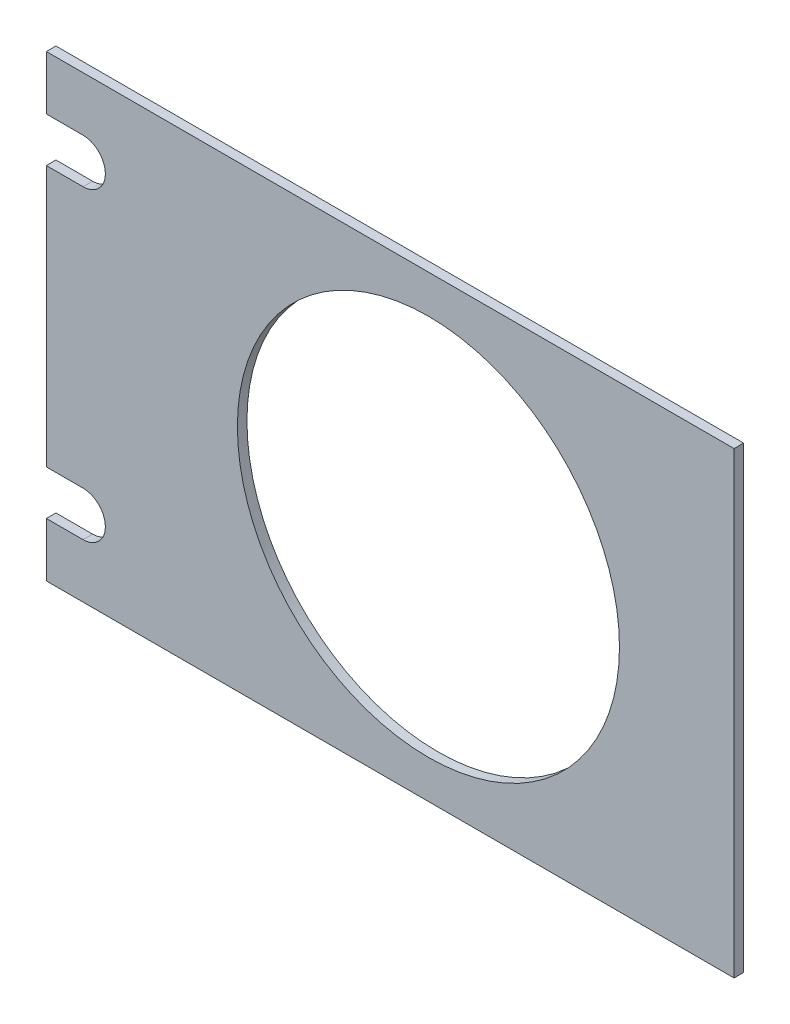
ISO-10303-21;
HEADER;
FILE_DESCRIPTION(('STEP AP214'),'2;1');
FILE_NAME('part.step','',(''),(''),'','','');
FILE_SCHEMA(('AUTOMOTIVE_DESIGN { 1 0 10303 214 1 1 1 1 }'));
ENDSEC;
DATA;
#1=APPLICATION_CONTEXT('core data for automotive mechanical design processes');
#2=APPLICATION_PROTOCOL_DEFINITION('international standard','automotive_design',2000,#1);
#3=PRODUCT_CONTEXT('',#1,'mechanical');
#4=PRODUCT('Part','Part','',(#3));
#5=PRODUCT_RELATED_PRODUCT_CATEGORY('part','',(#4));
#6=PRODUCT_DEFINITION_FORMATION('','',#4);
#7=PRODUCT_DEFINITION_CONTEXT('part definition',#1,'design');
#8=PRODUCT_DEFINITION('design','',#6,#7);
#9=PRODUCT_DEFINITION_SHAPE('','',#8);
#10=(LENGTH_UNIT() NAMED_UNIT(*) SI_UNIT(.MILLI.,.METRE.));
#11=(NAMED_UNIT(*) PLANE_ANGLE_UNIT() SI_UNIT($,.RADIAN.));
#12=(NAMED_UNIT(*) SI_UNIT($,.STERADIAN.) SOLID_ANGLE_UNIT());
#13=UNCERTAINTY_MEASURE_WITH_UNIT(LENGTH_MEASURE(1.E-05),#10,'distance_accuracy_value','');
#14=(GEOMETRIC_REPRESENTATION_CONTEXT(3) GLOBAL_UNCERTAINTY_ASSIGNED_CONTEXT((#13)) GLOBAL_UNIT_ASSIGNED_CONTEXT((#10,
#11,#12)) REPRESENTATION_CONTEXT('',''));
#15=CARTESIAN_POINT('',(0.,0.,0.));
#16=DIRECTION('',(0.,0.,1.));
#17=DIRECTION('',(1.,0.,0.));
#18=AXIS2_PLACEMENT_3D('',#15,#16,#17);
#19=CARTESIAN_POINT('',(1.524,-6.35,0.1984375));
#20=DIRECTION('',(0.,0.,-1.));
#21=DIRECTION('',(-1.,0.,0.));
#22=AXIS2_PLACEMENT_3D('',#19,#20,#21);
#23=PLANE('',#22);
#24=DIRECTION('',(0.,-1.,0.));
#25=VECTOR('',#24,1.);
#26=CARTESIAN_POINT('',(0.,-9.525,0.1984375));
#27=LINE('',#26,#25);
#28=CARTESIAN_POINT('',(0.,-7.2771,0.1984375));
#29=VERTEX_POINT('',#28);
#30=CARTESIAN_POINT('',(0.,-9.525,0.1984375));
#31=VERTEX_POINT('',#30);
#32=EDGE_CURVE('E167',#29,#31,#27,.T.);
#33=ORIENTED_EDGE('',*,*,#32,.T.);
#34=DIRECTION('',(1.,0.,0.));
#35=VECTOR('',#34,1.);
#36=CARTESIAN_POINT('',(0.,-9.525,0.1984375));
#37=LINE('',#36,#35);
#38=CARTESIAN_POINT('',(28.575,-9.525,0.1984375));
#39=VERTEX_POINT('',#38);
#40=EDGE_CURVE('E136',#31,#39,#37,.T.);
#41=ORIENTED_EDGE('',*,*,#40,.T.);
#42=DIRECTION('',(0.,1.,0.));
#43=VECTOR('',#42,1.);
#44=CARTESIAN_POINT('',(28.575,-9.525,0.1984375));
#45=LINE('',#44,#43);
#46=CARTESIAN_POINT('',(28.575,9.525,0.1984375));
#47=VERTEX_POINT('',#46);
#48=EDGE_CURVE('E170',#39,#47,#45,.T.);
#49=ORIENTED_EDGE('',*,*,#48,.T.);
#50=DIRECTION('',(-1.,0.,0.));
#51=VECTOR('',#50,1.);
#52=CARTESIAN_POINT('',(0.,9.525,0.1984375));
#53=LINE('',#52,#51);
#54=CARTESIAN_POINT('',(0.,9.525,0.1984375));
#55=VERTEX_POINT('',#54);
#56=EDGE_CURVE('E172',#47,#55,#53,.T.);
#57=ORIENTED_EDGE('',*,*,#56,.T.);
#58=DIRECTION('',(0.,-1.,0.));
#59=VECTOR('',#58,1.);
#60=CARTESIAN_POINT('',(0.,7.2771,0.1984375));
#61=LINE('',#60,#59);
#62=CARTESIAN_POINT('',(0.,7.2771,0.1984375));
#63=VERTEX_POINT('',#62);
#64=EDGE_CURVE('E174',#55,#63,#61,.T.);
#65=ORIENTED_EDGE('',*,*,#64,.T.);
#66=DIRECTION('',(1.,0.,0.));
#67=VECTOR('',#66,1.);
#68=CARTESIAN_POINT('',(0.,7.2771,0.1984375));
#69=LINE('',#68,#67);
#70=CARTESIAN_POINT('',(1.524,7.2771,0.1984375));
#71=VERTEX_POINT('',#70);
#72=EDGE_CURVE('E176',#63,#71,#69,.T.);
#73=ORIENTED_EDGE('',*,*,#72,.T.);
#74=CARTESIAN_POINT('',(1.524,6.35,0.1984375));
#75=DIRECTION('',(0.,0.,-1.));
#76=DIRECTION('',(1.,0.,0.));
#77=AXIS2_PLACEMENT_3D('',#74,#75,#76);
#78=CIRCLE('',#77,0.9271);
#79=CARTESIAN_POINT('',(1.524,5.4229,0.1984375));
#80=VERTEX_POINT('',#79);
#81=EDGE_CURVE('E178',#71,#80,#78,.T.);
#82=ORIENTED_EDGE('',*,*,#81,.T.);
#83=DIRECTION('',(-1.,0.,0.));
#84=VECTOR('',#83,1.);
#85=CARTESIAN_POINT('',(0.,5.4229,0.1984375));
#86=LINE('',#85,#84);
#87=CARTESIAN_POINT('',(0.,5.4229,0.1984375));
#88=VERTEX_POINT('',#87);
#89=EDGE_CURVE('E180',#80,#88,#86,.T.);
#90=ORIENTED_EDGE('',*,*,#89,.T.);
#91=DIRECTION('',(0.,-1.,0.));
#92=VECTOR('',#91,1.);
#93=CARTESIAN_POINT('',(0.,-5.4229,0.1984375));
#94=LINE('',#93,#92);
#95=CARTESIAN_POINT('',(0.,-5.4229,0.1984375));
#96=VERTEX_POINT('',#95);
#97=EDGE_CURVE('E182',#88,#96,#94,.T.);
#98=ORIENTED_EDGE('',*,*,#97,.T.);
#99=DIRECTION('',(1.,0.,0.));
#100=VECTOR('',#99,1.);
#101=CARTESIAN_POINT('',(0.,-5.4229,0.1984375));
#102=LINE('',#101,#100);
#103=CARTESIAN_POINT('',(1.524,-5.4229,0.1984375));
#104=VERTEX_POINT('',#103);
#105=EDGE_CURVE('E184',#96,#104,#102,.T.);
#106=ORIENTED_EDGE('',*,*,#105,.T.);
#107=CARTESIAN_POINT('',(1.524,-6.35,0.1984375));
#108=DIRECTION('',(0.,0.,-1.));
#109=DIRECTION('',(-1.,0.,0.));
#110=AXIS2_PLACEMENT_3D('',#107,#108,#109);
#111=CIRCLE('',#110,0.9271);
#112=CARTESIAN_POINT('',(1.524,-7.2771,0.1984375));
#113=VERTEX_POINT('',#112);
#114=EDGE_CURVE('E53',#104,#113,#111,.T.);
#115=ORIENTED_EDGE('',*,*,#114,.T.);
#116=DIRECTION('',(-1.,0.,0.));
#117=VECTOR('',#116,1.);
#118=CARTESIAN_POINT('',(0.,-7.2771,0.1984375));
#119=LINE('',#118,#117);
#120=EDGE_CURVE('E48',#113,#29,#119,.T.);
#121=ORIENTED_EDGE('',*,*,#120,.T.);
#122=EDGE_LOOP('',(#33,#41,#49,#57,#65,#73,#82,#90,#98,#106,#115,#121));
#123=FACE_BOUND('',#122,.T.);
#124=CARTESIAN_POINT('',(15.875,0.,0.1984375));
#125=DIRECTION('',(0.,0.,1.));
#126=DIRECTION('',(1.,0.,0.));
#127=AXIS2_PLACEMENT_3D('',#124,#125,#126);
#128=CIRCLE('',#127,7.9375);
#129=CARTESIAN_POINT('',(23.8125,0.,0.1984375));
#130=VERTEX_POINT('',#129);
#131=EDGE_CURVE('E141',#130,#130,#128,.T.);
#132=ORIENTED_EDGE('',*,*,#131,.F.);
#133=EDGE_LOOP('',(#132));
#134=FACE_BOUND('',#133,.T.);
#135=ADVANCED_FACE('F33',(#123,#134),#23,.F.);
#136=CARTESIAN_POINT('',(1.524,-6.35,-0.1984375));
#137=DIRECTION('',(0.,0.,-1.));
#138=DIRECTION('',(-1.,0.,0.));
#139=AXIS2_PLACEMENT_3D('',#136,#137,#138);
#140=PLANE('',#139);
#141=DIRECTION('',(0.,-1.,0.));
#142=VECTOR('',#141,1.);
#143=CARTESIAN_POINT('',(0.,-9.525,-0.1984375));
#144=LINE('',#143,#142);
#145=CARTESIAN_POINT('',(0.,-7.2771,-0.1984375));
#146=VERTEX_POINT('',#145);
#147=CARTESIAN_POINT('',(0.,-9.525,-0.1984375));
#148=VERTEX_POINT('',#147);
#149=EDGE_CURVE('E127',#146,#148,#144,.T.);
#150=ORIENTED_EDGE('',*,*,#149,.F.);
#151=DIRECTION('',(-1.,0.,0.));
#152=VECTOR('',#151,1.);
#153=CARTESIAN_POINT('',(0.,-7.2771,-0.1984375));
#154=LINE('',#153,#152);
#155=CARTESIAN_POINT('',(1.524,-7.2771,-0.1984375));
#156=VERTEX_POINT('',#155);
#157=EDGE_CURVE('E165',#156,#146,#154,.T.);
#158=ORIENTED_EDGE('',*,*,#157,.F.);
#159=CARTESIAN_POINT('',(1.524,-6.35,-0.1984375));
#160=DIRECTION('',(0.,0.,-1.));
#161=DIRECTION('',(-1.,0.,0.));
#162=AXIS2_PLACEMENT_3D('',#159,#160,#161);
#163=CIRCLE('',#162,0.9271);
#164=CARTESIAN_POINT('',(1.524,-5.4229,-0.1984375));
#165=VERTEX_POINT('',#164);
#166=EDGE_CURVE('E163',#165,#156,#163,.T.);
#167=ORIENTED_EDGE('',*,*,#166,.F.);
#168=DIRECTION('',(1.,0.,0.));
#169=VECTOR('',#168,1.);
#170=CARTESIAN_POINT('',(0.,-5.4229,-0.1984375));
#171=LINE('',#170,#169);
#172=CARTESIAN_POINT('',(0.,-5.4229,-0.1984375));
#173=VERTEX_POINT('',#172);
#174=EDGE_CURVE('E161',#173,#165,#171,.T.);
#175=ORIENTED_EDGE('',*,*,#174,.F.);
#176=DIRECTION('',(0.,-1.,0.));
#177=VECTOR('',#176,1.);
#178=CARTESIAN_POINT('',(0.,-5.4229,-0.1984375));
#179=LINE('',#178,#177);
#180=CARTESIAN_POINT('',(0.,5.4229,-0.1984375));
#181=VERTEX_POINT('',#180);
#182=EDGE_CURVE('E159',#181,#173,#179,.T.);
#183=ORIENTED_EDGE('',*,*,#182,.F.);
#184=DIRECTION('',(-1.,0.,0.));
#185=VECTOR('',#184,1.);
#186=CARTESIAN_POINT('',(0.,5.4229,-0.1984375));
#187=LINE('',#186,#185);
#188=CARTESIAN_POINT('',(1.524,5.4229,-0.1984375));
#189=VERTEX_POINT('',#188);
#190=EDGE_CURVE('E157',#189,#181,#187,.T.);
#191=ORIENTED_EDGE('',*,*,#190,.F.);
#192=CARTESIAN_POINT('',(1.524,6.35,-0.1984375));
#193=DIRECTION('',(0.,0.,-1.));
#194=DIRECTION('',(1.,0.,0.));
#195=AXIS2_PLACEMENT_3D('',#192,#193,#194);
#196=CIRCLE('',#195,0.9271);
#197=CARTESIAN_POINT('',(1.524,7.2771,-0.1984375));
#198=VERTEX_POINT('',#197);
#199=EDGE_CURVE('E155',#198,#189,#196,.T.);
#200=ORIENTED_EDGE('',*,*,#199,.F.);
#201=DIRECTION('',(1.,0.,0.));
#202=VECTOR('',#201,1.);
#203=CARTESIAN_POINT('',(0.,7.2771,-0.1984375));
#204=LINE('',#203,#202);
#205=CARTESIAN_POINT('',(0.,7.2771,-0.1984375));
#206=VERTEX_POINT('',#205);
#207=EDGE_CURVE('E153',#206,#198,#204,.T.);
#208=ORIENTED_EDGE('',*,*,#207,.F.);
#209=DIRECTION('',(0.,-1.,0.));
#210=VECTOR('',#209,1.);
#211=CARTESIAN_POINT('',(0.,7.2771,-0.1984375));
#212=LINE('',#211,#210);
#213=CARTESIAN_POINT('',(0.,9.525,-0.1984375));
#214=VERTEX_POINT('',#213);
#215=EDGE_CURVE('E151',#214,#206,#212,.T.);
#216=ORIENTED_EDGE('',*,*,#215,.F.);
#217=DIRECTION('',(-1.,0.,0.));
#218=VECTOR('',#217,1.);
#219=CARTESIAN_POINT('',(0.,9.525,-0.1984375));
#220=LINE('',#219,#218);
#221=CARTESIAN_POINT('',(28.575,9.525,-0.1984375));
#222=VERTEX_POINT('',#221);
#223=EDGE_CURVE('E149',#222,#214,#220,.T.);
#224=ORIENTED_EDGE('',*,*,#223,.F.);
#225=DIRECTION('',(0.,1.,0.));
#226=VECTOR('',#225,1.);
#227=CARTESIAN_POINT('',(28.575,-9.525,-0.1984375));
#228=LINE('',#227,#226);
#229=CARTESIAN_POINT('',(28.575,-9.525,-0.1984375));
#230=VERTEX_POINT('',#229);
#231=EDGE_CURVE('E129',#230,#222,#228,.T.);
#232=ORIENTED_EDGE('',*,*,#231,.F.);
#233=DIRECTION('',(1.,0.,0.));
#234=VECTOR('',#233,1.);
#235=CARTESIAN_POINT('',(0.,-9.525,-0.1984375));
#236=LINE('',#235,#234);
#237=EDGE_CURVE('E122',#148,#230,#236,.T.);
#238=ORIENTED_EDGE('',*,*,#237,.F.);
#239=EDGE_LOOP('',(#150,#158,#167,#175,#183,#191,#200,#208,#216,#224,#232,#238));
#240=FACE_BOUND('',#239,.T.);
#241=CARTESIAN_POINT('',(15.875,0.,-0.1984375));
#242=DIRECTION('',(0.,0.,1.));
#243=DIRECTION('',(1.,0.,0.));
#244=AXIS2_PLACEMENT_3D('',#241,#242,#243);
#245=CIRCLE('',#244,7.9375);
#246=CARTESIAN_POINT('',(23.8125,0.,-0.1984375));
#247=VERTEX_POINT('',#246);
#248=EDGE_CURVE('E144',#247,#247,#245,.T.);
#249=ORIENTED_EDGE('',*,*,#248,.T.);
#250=EDGE_LOOP('',(#249));
#251=FACE_BOUND('',#250,.T.);
#252=ADVANCED_FACE('F123',(#240,#251),#140,.T.);
#253=CARTESIAN_POINT('',(0.,-9.525,0.1984375));
#254=DIRECTION('',(1.,0.,0.));
#255=DIRECTION('',(0.,0.,-1.));
#256=AXIS2_PLACEMENT_3D('',#253,#254,#255);
#257=PLANE('',#256);
#258=ORIENTED_EDGE('',*,*,#149,.T.);
#259=DIRECTION('',(0.,0.,-1.));
#260=VECTOR('',#259,1.);
#261=CARTESIAN_POINT('',(0.,-9.525,0.1984375));
#262=LINE('',#261,#260);
#263=EDGE_CURVE('E11',#31,#148,#262,.T.);
#264=ORIENTED_EDGE('',*,*,#263,.F.);
#265=ORIENTED_EDGE('',*,*,#32,.F.);
#266=DIRECTION('',(0.,0.,-1.));
#267=VECTOR('',#266,1.);
#268=CARTESIAN_POINT('',(0.,-7.2771,0.1984375));
#269=LINE('',#268,#267);
#270=EDGE_CURVE('E140',#29,#146,#269,.T.);
#271=ORIENTED_EDGE('',*,*,#270,.T.);
#272=EDGE_LOOP('',(#258,#264,#265,#271));
#273=FACE_BOUND('',#272,.T.);
#274=ADVANCED_FACE('F35',(#273),#257,.F.);
#275=CARTESIAN_POINT('',(0.,-9.525,0.1984375));
#276=DIRECTION('',(0.,1.,0.));
#277=DIRECTION('',(0.,0.,1.));
#278=AXIS2_PLACEMENT_3D('',#275,#276,#277);
#279=PLANE('',#278);
#280=ORIENTED_EDGE('',*,*,#237,.T.);
#281=DIRECTION('',(0.,0.,-1.));
#282=VECTOR('',#281,1.);
#283=CARTESIAN_POINT('',(28.575,-9.525,0.1984375));
#284=LINE('',#283,#282);
#285=EDGE_CURVE('E41',#39,#230,#284,.T.);
#286=ORIENTED_EDGE('',*,*,#285,.F.);
#287=ORIENTED_EDGE('',*,*,#40,.F.);
#288=ORIENTED_EDGE('',*,*,#263,.T.);
#289=EDGE_LOOP('',(#280,#286,#287,#288));
#290=FACE_BOUND('',#289,.T.);
#291=ADVANCED_FACE('F135',(#290),#279,.F.);
#292=CARTESIAN_POINT('',(28.575,-9.525,0.1984375));
#293=DIRECTION('',(-1.,0.,0.));
#294=DIRECTION('',(0.,0.,1.));
#295=AXIS2_PLACEMENT_3D('',#292,#293,#294);
#296=PLANE('',#295);
#297=ORIENTED_EDGE('',*,*,#231,.T.);
#298=DIRECTION('',(0.,0.,-1.));
#299=VECTOR('',#298,1.);
#300=CARTESIAN_POINT('',(28.575,9.525,0.1984375));
#301=LINE('',#300,#299);
#302=EDGE_CURVE('E213',#47,#222,#301,.T.);
#303=ORIENTED_EDGE('',*,*,#302,.F.);
#304=ORIENTED_EDGE('',*,*,#48,.F.);
#305=ORIENTED_EDGE('',*,*,#285,.T.);
#306=EDGE_LOOP('',(#297,#303,#304,#305));
#307=FACE_BOUND('',#306,.T.);
#308=ADVANCED_FACE('F217',(#307),#296,.F.);
#309=CARTESIAN_POINT('',(0.,9.525,0.1984375));
#310=DIRECTION('',(0.,-1.,0.));
#311=DIRECTION('',(0.,0.,-1.));
#312=AXIS2_PLACEMENT_3D('',#309,#310,#311);
#313=PLANE('',#312);
#314=ORIENTED_EDGE('',*,*,#223,.T.);
#315=DIRECTION('',(0.,0.,-1.));
#316=VECTOR('',#315,1.);
#317=CARTESIAN_POINT('',(0.,9.525,0.1984375));
#318=LINE('',#317,#316);
#319=EDGE_CURVE('E210',#55,#214,#318,.T.);
#320=ORIENTED_EDGE('',*,*,#319,.F.);
#321=ORIENTED_EDGE('',*,*,#56,.F.);
#322=ORIENTED_EDGE('',*,*,#302,.T.);
#323=EDGE_LOOP('',(#314,#320,#321,#322));
#324=FACE_BOUND('',#323,.T.);
#325=ADVANCED_FACE('F225',(#324),#313,.F.);
#326=CARTESIAN_POINT('',(0.,7.2771,0.1984375));
#327=DIRECTION('',(1.,0.,0.));
#328=DIRECTION('',(0.,0.,-1.));
#329=AXIS2_PLACEMENT_3D('',#326,#327,#328);
#330=PLANE('',#329);
#331=ORIENTED_EDGE('',*,*,#215,.T.);
#332=DIRECTION('',(0.,0.,-1.));
#333=VECTOR('',#332,1.);
#334=CARTESIAN_POINT('',(0.,7.2771,0.1984375));
#335=LINE('',#334,#333);
#336=EDGE_CURVE('E207',#63,#206,#335,.T.);
#337=ORIENTED_EDGE('',*,*,#336,.F.);
#338=ORIENTED_EDGE('',*,*,#64,.F.);
#339=ORIENTED_EDGE('',*,*,#319,.T.);
#340=EDGE_LOOP('',(#331,#337,#338,#339));
#341=FACE_BOUND('',#340,.T.);
#342=ADVANCED_FACE('F228',(#341),#330,.F.);
#343=CARTESIAN_POINT('',(0.,7.2771,0.1984375));
#344=DIRECTION('',(0.,1.,0.));
#345=DIRECTION('',(0.,0.,1.));
#346=AXIS2_PLACEMENT_3D('',#343,#344,#345);
#347=PLANE('',#346);
#348=ORIENTED_EDGE('',*,*,#207,.T.);
#349=DIRECTION('',(0.,0.,-1.));
#350=VECTOR('',#349,1.);
#351=CARTESIAN_POINT('',(1.524,7.2771,0.1984375));
#352=LINE('',#351,#350);
#353=EDGE_CURVE('E204',#71,#198,#352,.T.);
#354=ORIENTED_EDGE('',*,*,#353,.F.);
#355=ORIENTED_EDGE('',*,*,#72,.F.);
#356=ORIENTED_EDGE('',*,*,#336,.T.);
#357=EDGE_LOOP('',(#348,#354,#355,#356));
#358=FACE_BOUND('',#357,.T.);
#359=ADVANCED_FACE('F233',(#358),#347,.F.);
#360=CARTESIAN_POINT('',(1.524,6.35,0.1984375));
#361=DIRECTION('',(0.,0.,-1.));
#362=DIRECTION('',(-1.,0.,0.));
#363=AXIS2_PLACEMENT_3D('',#360,#361,#362);
#364=CYLINDRICAL_SURFACE('',#363,0.9271);
#365=ORIENTED_EDGE('',*,*,#199,.T.);
#366=DIRECTION('',(0.,0.,-1.));
#367=VECTOR('',#366,1.);
#368=CARTESIAN_POINT('',(1.524,5.4229,0.1984375));
#369=LINE('',#368,#367);
#370=EDGE_CURVE('E201',#80,#189,#369,.T.);
#371=ORIENTED_EDGE('',*,*,#370,.F.);
#372=ORIENTED_EDGE('',*,*,#81,.F.);
#373=ORIENTED_EDGE('',*,*,#353,.T.);
#374=EDGE_LOOP('',(#365,#371,#372,#373));
#375=FACE_BOUND('',#374,.T.);
#376=ADVANCED_FACE('F239',(#375),#364,.F.);
#377=CARTESIAN_POINT('',(0.,5.4229,0.1984375));
#378=DIRECTION('',(0.,-1.,0.));
#379=DIRECTION('',(0.,0.,-1.));
#380=AXIS2_PLACEMENT_3D('',#377,#378,#379);
#381=PLANE('',#380);
#382=ORIENTED_EDGE('',*,*,#190,.T.);
#383=DIRECTION('',(0.,0.,-1.));
#384=VECTOR('',#383,1.);
#385=CARTESIAN_POINT('',(0.,5.4229,0.1984375));
#386=LINE('',#385,#384);
#387=EDGE_CURVE('E198',#88,#181,#386,.T.);
#388=ORIENTED_EDGE('',*,*,#387,.F.);
#389=ORIENTED_EDGE('',*,*,#89,.F.);
#390=ORIENTED_EDGE('',*,*,#370,.T.);
#391=EDGE_LOOP('',(#382,#388,#389,#390));
#392=FACE_BOUND('',#391,.T.);
#393=ADVANCED_FACE('F243',(#392),#381,.F.);
#394=CARTESIAN_POINT('',(0.,-5.4229,0.1984375));
#395=DIRECTION('',(1.,0.,0.));
#396=DIRECTION('',(0.,0.,-1.));
#397=AXIS2_PLACEMENT_3D('',#394,#395,#396);
#398=PLANE('',#397);
#399=ORIENTED_EDGE('',*,*,#182,.T.);
#400=DIRECTION('',(0.,0.,-1.));
#401=VECTOR('',#400,1.);
#402=CARTESIAN_POINT('',(0.,-5.4229,0.1984375));
#403=LINE('',#402,#401);
#404=EDGE_CURVE('E195',#96,#173,#403,.T.);
#405=ORIENTED_EDGE('',*,*,#404,.F.);
#406=ORIENTED_EDGE('',*,*,#97,.F.);
#407=ORIENTED_EDGE('',*,*,#387,.T.);
#408=EDGE_LOOP('',(#399,#405,#406,#407));
#409=FACE_BOUND('',#408,.T.);
#410=ADVANCED_FACE('F248',(#409),#398,.F.);
#411=CARTESIAN_POINT('',(0.,-5.4229,0.1984375));
#412=DIRECTION('',(0.,1.,0.));
#413=DIRECTION('',(0.,0.,1.));
#414=AXIS2_PLACEMENT_3D('',#411,#412,#413);
#415=PLANE('',#414);
#416=ORIENTED_EDGE('',*,*,#174,.T.);
#417=DIRECTION('',(0.,0.,-1.));
#418=VECTOR('',#417,1.);
#419=CARTESIAN_POINT('',(1.524,-5.4229,0.1984375));
#420=LINE('',#419,#418);
#421=EDGE_CURVE('E192',#104,#165,#420,.T.);
#422=ORIENTED_EDGE('',*,*,#421,.F.);
#423=ORIENTED_EDGE('',*,*,#105,.F.);
#424=ORIENTED_EDGE('',*,*,#404,.T.);
#425=EDGE_LOOP('',(#416,#422,#423,#424));
#426=FACE_BOUND('',#425,.T.);
#427=ADVANCED_FACE('F252',(#426),#415,.F.);
#428=CARTESIAN_POINT('',(1.524,-6.35,0.1984375));
#429=DIRECTION('',(0.,0.,-1.));
#430=DIRECTION('',(-1.,0.,0.));
#431=AXIS2_PLACEMENT_3D('',#428,#429,#430);
#432=CYLINDRICAL_SURFACE('',#431,0.9271);
#433=ORIENTED_EDGE('',*,*,#166,.T.);
#434=DIRECTION('',(0.,0.,-1.));
#435=VECTOR('',#434,1.);
#436=CARTESIAN_POINT('',(1.524,-7.2771,0.1984375));
#437=LINE('',#436,#435);
#438=EDGE_CURVE('E189',#113,#156,#437,.T.);
#439=ORIENTED_EDGE('',*,*,#438,.F.);
#440=ORIENTED_EDGE('',*,*,#114,.F.);
#441=ORIENTED_EDGE('',*,*,#421,.T.);
#442=EDGE_LOOP('',(#433,#439,#440,#441));
#443=FACE_BOUND('',#442,.T.);
#444=ADVANCED_FACE('F256',(#443),#432,.F.);
#445=CARTESIAN_POINT('',(0.,-7.2771,0.1984375));
#446=DIRECTION('',(0.,-1.,0.));
#447=DIRECTION('',(0.,0.,-1.));
#448=AXIS2_PLACEMENT_3D('',#445,#446,#447);
#449=PLANE('',#448);
#450=ORIENTED_EDGE('',*,*,#157,.T.);
#451=ORIENTED_EDGE('',*,*,#270,.F.);
#452=ORIENTED_EDGE('',*,*,#120,.F.);
#453=ORIENTED_EDGE('',*,*,#438,.T.);
#454=EDGE_LOOP('',(#450,#451,#452,#453));
#455=FACE_BOUND('',#454,.T.);
#456=ADVANCED_FACE('F258',(#455),#449,.F.);
#457=CARTESIAN_POINT('',(15.875,0.,0.1984375));
#458=DIRECTION('',(0.,0.,-1.));
#459=DIRECTION('',(-1.,0.,0.));
#460=AXIS2_PLACEMENT_3D('',#457,#458,#459);
#461=CYLINDRICAL_SURFACE('',#460,7.9375);
#462=ORIENTED_EDGE('',*,*,#131,.T.);
#463=EDGE_LOOP('',(#462));
#464=FACE_BOUND('',#463,.T.);
#465=ORIENTED_EDGE('',*,*,#248,.F.);
#466=EDGE_LOOP('',(#465));
#467=FACE_BOUND('',#466,.T.);
#468=ADVANCED_FACE('F260',(#464,#467),#461,.F.);
#469=CLOSED_SHELL('',(#135,#252,#274,#291,#308,#325,#342,#359,#376,#393,#410,#427,#444,#456,#468));
#470=MANIFOLD_SOLID_BREP('B2',#469);
#471=ADVANCED_BREP_SHAPE_REPRESENTATION('',(#18,#470),#14);
#472=SHAPE_DEFINITION_REPRESENTATION(#9,#471);
ENDSEC;
END-ISO-10303-21;
